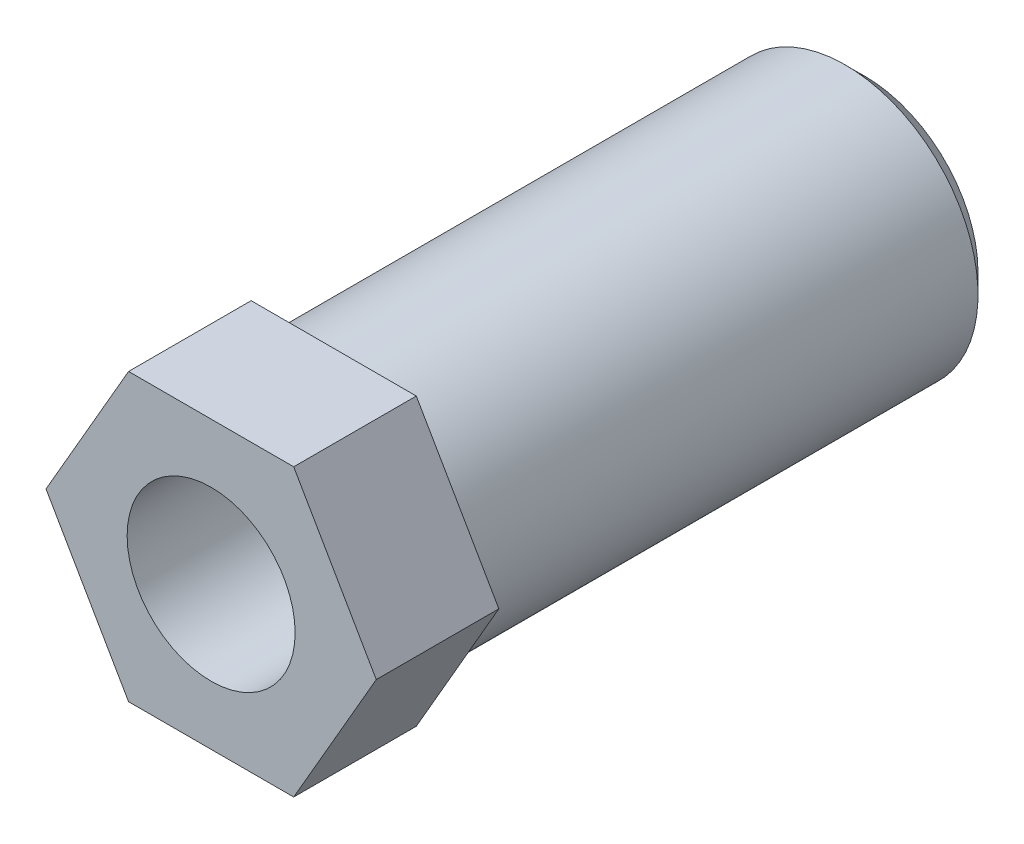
ISO-10303-21;
HEADER;
FILE_DESCRIPTION(('STEP AP214'),'2;1');
FILE_NAME('part.step','',(''),(''),'','','');
FILE_SCHEMA(('AUTOMOTIVE_DESIGN { 1 0 10303 214 1 1 1 1 }'));
ENDSEC;
DATA;
#1=APPLICATION_CONTEXT('core data for automotive mechanical design processes');
#2=APPLICATION_PROTOCOL_DEFINITION('international standard','automotive_design',2000,#1);
#3=PRODUCT_CONTEXT('',#1,'mechanical');
#4=PRODUCT('Part','Part','',(#3));
#5=PRODUCT_RELATED_PRODUCT_CATEGORY('part','',(#4));
#6=PRODUCT_DEFINITION_FORMATION('','',#4);
#7=PRODUCT_DEFINITION_CONTEXT('part definition',#1,'design');
#8=PRODUCT_DEFINITION('design','',#6,#7);
#9=PRODUCT_DEFINITION_SHAPE('','',#8);
#10=(LENGTH_UNIT() NAMED_UNIT(*) SI_UNIT(.MILLI.,.METRE.));
#11=(NAMED_UNIT(*) PLANE_ANGLE_UNIT() SI_UNIT($,.RADIAN.));
#12=(NAMED_UNIT(*) SI_UNIT($,.STERADIAN.) SOLID_ANGLE_UNIT());
#13=UNCERTAINTY_MEASURE_WITH_UNIT(LENGTH_MEASURE(1.E-05),#10,'distance_accuracy_value','');
#14=(GEOMETRIC_REPRESENTATION_CONTEXT(3) GLOBAL_UNCERTAINTY_ASSIGNED_CONTEXT((#13)) GLOBAL_UNIT_ASSIGNED_CONTEXT((#10,
#11,#12)) REPRESENTATION_CONTEXT('',''));
#15=CARTESIAN_POINT('',(0.,0.,0.));
#16=DIRECTION('',(0.,0.,1.));
#17=DIRECTION('',(1.,0.,0.));
#18=AXIS2_PLACEMENT_3D('',#15,#16,#17);
#19=CARTESIAN_POINT('',(3.20790243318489,-5.55625,25.4));
#20=DIRECTION('',(-0.866025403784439,0.5,0.));
#21=DIRECTION('',(-0.5,-0.866025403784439,0.));
#22=AXIS2_PLACEMENT_3D('',#19,#20,#21);
#23=PLANE('',#22);
#24=DIRECTION('',(-0.5,-0.866025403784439,0.));
#25=VECTOR('',#24,1.);
#26=CARTESIAN_POINT('',(3.20790243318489,-5.55625,20.6375));
#27=LINE('',#26,#25);
#28=CARTESIAN_POINT('',(6.41580486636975,0.,20.6375));
#29=VERTEX_POINT('',#28);
#30=CARTESIAN_POINT('',(3.20790243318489,-5.55625,20.6375));
#31=VERTEX_POINT('',#30);
#32=EDGE_CURVE('E48',#29,#31,#27,.T.);
#33=ORIENTED_EDGE('',*,*,#32,.F.);
#34=DIRECTION('',(0.,0.,-1.));
#35=VECTOR('',#34,1.);
#36=CARTESIAN_POINT('',(6.41580486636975,0.,25.4));
#37=LINE('',#36,#35);
#38=CARTESIAN_POINT('',(6.41580486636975,0.,25.4));
#39=VERTEX_POINT('',#38);
#40=EDGE_CURVE('E93',#39,#29,#37,.T.);
#41=ORIENTED_EDGE('',*,*,#40,.F.);
#42=DIRECTION('',(0.5,0.866025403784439,0.));
#43=VECTOR('',#42,1.);
#44=CARTESIAN_POINT('',(3.20790243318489,-5.55625,25.4));
#45=LINE('',#44,#43);
#46=CARTESIAN_POINT('',(3.20790243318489,-5.55625,25.4));
#47=VERTEX_POINT('',#46);
#48=EDGE_CURVE('E161',#47,#39,#45,.T.);
#49=ORIENTED_EDGE('',*,*,#48,.F.);
#50=DIRECTION('',(0.,0.,-1.));
#51=VECTOR('',#50,1.);
#52=CARTESIAN_POINT('',(3.20790243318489,-5.55625,25.4));
#53=LINE('',#52,#51);
#54=EDGE_CURVE('E107',#47,#31,#53,.T.);
#55=ORIENTED_EDGE('',*,*,#54,.T.);
#56=EDGE_LOOP('',(#33,#41,#49,#55));
#57=FACE_BOUND('',#56,.T.);
#58=ADVANCED_FACE('F34',(#57),#23,.F.);
#59=CARTESIAN_POINT('',(6.41580486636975,0.,25.4));
#60=DIRECTION('',(-0.866025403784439,-0.5,0.));
#61=DIRECTION('',(0.5,-0.866025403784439,0.));
#62=AXIS2_PLACEMENT_3D('',#59,#60,#61);
#63=PLANE('',#62);
#64=DIRECTION('',(0.5,-0.866025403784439,0.));
#65=VECTOR('',#64,1.);
#66=CARTESIAN_POINT('',(6.41580486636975,0.,20.6375));
#67=LINE('',#66,#65);
#68=CARTESIAN_POINT('',(3.20790243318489,5.55625,20.6375));
#69=VERTEX_POINT('',#68);
#70=EDGE_CURVE('E154',#69,#29,#67,.T.);
#71=ORIENTED_EDGE('',*,*,#70,.F.);
#72=DIRECTION('',(0.,0.,-1.));
#73=VECTOR('',#72,1.);
#74=CARTESIAN_POINT('',(3.20790243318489,5.55625,25.4));
#75=LINE('',#74,#73);
#76=CARTESIAN_POINT('',(3.20790243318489,5.55625,25.4));
#77=VERTEX_POINT('',#76);
#78=EDGE_CURVE('E116',#77,#69,#75,.T.);
#79=ORIENTED_EDGE('',*,*,#78,.F.);
#80=DIRECTION('',(-0.5,0.866025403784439,0.));
#81=VECTOR('',#80,1.);
#82=CARTESIAN_POINT('',(6.41580486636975,0.,25.4));
#83=LINE('',#82,#81);
#84=EDGE_CURVE('E158',#39,#77,#83,.T.);
#85=ORIENTED_EDGE('',*,*,#84,.F.);
#86=ORIENTED_EDGE('',*,*,#40,.T.);
#87=EDGE_LOOP('',(#71,#79,#85,#86));
#88=FACE_BOUND('',#87,.T.);
#89=ADVANCED_FACE('F144',(#88),#63,.F.);
#90=CARTESIAN_POINT('',(3.20790243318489,5.55625,25.4));
#91=DIRECTION('',(0.,-1.,0.));
#92=DIRECTION('',(0.,0.,-1.));
#93=AXIS2_PLACEMENT_3D('',#90,#91,#92);
#94=PLANE('',#93);
#95=DIRECTION('',(1.,0.,0.));
#96=VECTOR('',#95,1.);
#97=CARTESIAN_POINT('',(3.20790243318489,5.55625,20.6375));
#98=LINE('',#97,#96);
#99=CARTESIAN_POINT('',(-3.20790243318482,5.55625,20.6375));
#100=VERTEX_POINT('',#99);
#101=EDGE_CURVE('E177',#100,#69,#98,.T.);
#102=ORIENTED_EDGE('',*,*,#101,.F.);
#103=DIRECTION('',(0.,0.,-1.));
#104=VECTOR('',#103,1.);
#105=CARTESIAN_POINT('',(-3.20790243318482,5.55625,25.4));
#106=LINE('',#105,#104);
#107=CARTESIAN_POINT('',(-3.20790243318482,5.55625,25.4));
#108=VERTEX_POINT('',#107);
#109=EDGE_CURVE('E109',#108,#100,#106,.T.);
#110=ORIENTED_EDGE('',*,*,#109,.F.);
#111=DIRECTION('',(-1.,0.,0.));
#112=VECTOR('',#111,1.);
#113=CARTESIAN_POINT('',(3.20790243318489,5.55625,25.4));
#114=LINE('',#113,#112);
#115=EDGE_CURVE('E160',#77,#108,#114,.T.);
#116=ORIENTED_EDGE('',*,*,#115,.F.);
#117=ORIENTED_EDGE('',*,*,#78,.T.);
#118=EDGE_LOOP('',(#102,#110,#116,#117));
#119=FACE_BOUND('',#118,.T.);
#120=ADVANCED_FACE('F149',(#119),#94,.F.);
#121=CARTESIAN_POINT('',(-3.20790243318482,5.55625,25.4));
#122=DIRECTION('',(0.866025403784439,-0.5,0.));
#123=DIRECTION('',(0.5,0.866025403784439,0.));
#124=AXIS2_PLACEMENT_3D('',#121,#122,#123);
#125=PLANE('',#124);
#126=DIRECTION('',(0.5,0.866025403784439,0.));
#127=VECTOR('',#126,1.);
#128=CARTESIAN_POINT('',(-3.20790243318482,5.55625,20.6375));
#129=LINE('',#128,#127);
#130=CARTESIAN_POINT('',(-6.41580486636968,0.,20.6375));
#131=VERTEX_POINT('',#130);
#132=EDGE_CURVE('E103',#131,#100,#129,.T.);
#133=ORIENTED_EDGE('',*,*,#132,.F.);
#134=DIRECTION('',(0.,0.,-1.));
#135=VECTOR('',#134,1.);
#136=CARTESIAN_POINT('',(-6.41580486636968,0.,25.4));
#137=LINE('',#136,#135);
#138=CARTESIAN_POINT('',(-6.41580486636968,0.,25.4));
#139=VERTEX_POINT('',#138);
#140=EDGE_CURVE('E102',#139,#131,#137,.T.);
#141=ORIENTED_EDGE('',*,*,#140,.F.);
#142=DIRECTION('',(-0.5,-0.866025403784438,0.));
#143=VECTOR('',#142,1.);
#144=CARTESIAN_POINT('',(-3.20790243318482,5.55625,25.4));
#145=LINE('',#144,#143);
#146=EDGE_CURVE('E169',#108,#139,#145,.T.);
#147=ORIENTED_EDGE('',*,*,#146,.F.);
#148=ORIENTED_EDGE('',*,*,#109,.T.);
#149=EDGE_LOOP('',(#133,#141,#147,#148));
#150=FACE_BOUND('',#149,.T.);
#151=ADVANCED_FACE('F175',(#150),#125,.F.);
#152=CARTESIAN_POINT('',(-6.41580486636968,0.,25.4));
#153=DIRECTION('',(0.866025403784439,0.5,0.));
#154=DIRECTION('',(-0.5,0.866025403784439,0.));
#155=AXIS2_PLACEMENT_3D('',#152,#153,#154);
#156=PLANE('',#155);
#157=DIRECTION('',(-0.5,0.866025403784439,0.));
#158=VECTOR('',#157,1.);
#159=CARTESIAN_POINT('',(-6.41580486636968,0.,20.6375));
#160=LINE('',#159,#158);
#161=CARTESIAN_POINT('',(-3.20790243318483,-5.55625,20.6375));
#162=VERTEX_POINT('',#161);
#163=EDGE_CURVE('E87',#162,#131,#160,.T.);
#164=ORIENTED_EDGE('',*,*,#163,.F.);
#165=DIRECTION('',(0.,0.,-1.));
#166=VECTOR('',#165,1.);
#167=CARTESIAN_POINT('',(-3.20790243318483,-5.55625,25.4));
#168=LINE('',#167,#166);
#169=CARTESIAN_POINT('',(-3.20790243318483,-5.55625,25.4));
#170=VERTEX_POINT('',#169);
#171=EDGE_CURVE('E100',#170,#162,#168,.T.);
#172=ORIENTED_EDGE('',*,*,#171,.F.);
#173=DIRECTION('',(0.5,-0.866025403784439,0.));
#174=VECTOR('',#173,1.);
#175=CARTESIAN_POINT('',(-6.41580486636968,0.,25.4));
#176=LINE('',#175,#174);
#177=EDGE_CURVE('E171',#139,#170,#176,.T.);
#178=ORIENTED_EDGE('',*,*,#177,.F.);
#179=ORIENTED_EDGE('',*,*,#140,.T.);
#180=EDGE_LOOP('',(#164,#172,#178,#179));
#181=FACE_BOUND('',#180,.T.);
#182=ADVANCED_FACE('F98',(#181),#156,.F.);
#183=CARTESIAN_POINT('',(-3.20790243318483,-5.55625,25.4));
#184=DIRECTION('',(0.,1.,0.));
#185=DIRECTION('',(-1.,0.,0.));
#186=AXIS2_PLACEMENT_3D('',#183,#184,#185);
#187=PLANE('',#186);
#188=DIRECTION('',(-1.,0.,0.));
#189=VECTOR('',#188,1.);
#190=CARTESIAN_POINT('',(-3.20790243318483,-5.55625,20.6375));
#191=LINE('',#190,#189);
#192=EDGE_CURVE('E84',#31,#162,#191,.T.);
#193=ORIENTED_EDGE('',*,*,#192,.F.);
#194=ORIENTED_EDGE('',*,*,#54,.F.);
#195=DIRECTION('',(1.,0.,0.));
#196=VECTOR('',#195,1.);
#197=CARTESIAN_POINT('',(-3.20790243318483,-5.55625,25.4));
#198=LINE('',#197,#196);
#199=EDGE_CURVE('E56',#170,#47,#198,.T.);
#200=ORIENTED_EDGE('',*,*,#199,.F.);
#201=ORIENTED_EDGE('',*,*,#171,.T.);
#202=EDGE_LOOP('',(#193,#194,#200,#201));
#203=FACE_BOUND('',#202,.T.);
#204=ADVANCED_FACE('F106',(#203),#187,.F.);
#205=CARTESIAN_POINT('',(3.20790243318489,-5.55625,0.));
#206=DIRECTION('',(0.,0.,-1.));
#207=DIRECTION('',(-1.,0.,0.));
#208=AXIS2_PLACEMENT_3D('',#205,#206,#207);
#209=PLANE('',#208);
#210=CARTESIAN_POINT('',(0.,0.,0.));
#211=DIRECTION('',(0.,0.,-1.));
#212=DIRECTION('',(-1.,0.,0.));
#213=AXIS2_PLACEMENT_3D('',#210,#211,#212);
#214=CIRCLE('',#213,4.02589999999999);
#215=CARTESIAN_POINT('',(-4.02589999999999,0.,0.));
#216=VERTEX_POINT('',#215);
#217=EDGE_CURVE('E11',#216,#216,#214,.F.);
#218=ORIENTED_EDGE('',*,*,#217,.T.);
#219=EDGE_LOOP('',(#218));
#220=FACE_BOUND('',#219,.T.);
#221=CARTESIAN_POINT('',(0.,0.,0.));
#222=DIRECTION('',(0.,0.,-1.));
#223=DIRECTION('',(-1.,0.,0.));
#224=AXIS2_PLACEMENT_3D('',#221,#222,#223);
#225=CIRCLE('',#224,4.39419999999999);
#226=CARTESIAN_POINT('',(-4.39419999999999,0.,0.));
#227=VERTEX_POINT('',#226);
#228=EDGE_CURVE('E92',#227,#227,#225,.T.);
#229=ORIENTED_EDGE('',*,*,#228,.T.);
#230=EDGE_LOOP('',(#229));
#231=FACE_BOUND('',#230,.T.);
#232=ADVANCED_FACE('F194',(#220,#231),#209,.T.);
#233=CARTESIAN_POINT('',(3.20790243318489,-5.55625,25.4));
#234=DIRECTION('',(0.,0.,-1.));
#235=DIRECTION('',(-1.,0.,0.));
#236=AXIS2_PLACEMENT_3D('',#233,#234,#235);
#237=PLANE('',#236);
#238=CARTESIAN_POINT('',(0.,0.,25.4));
#239=DIRECTION('',(0.,0.,-1.));
#240=DIRECTION('',(-1.,0.,0.));
#241=AXIS2_PLACEMENT_3D('',#238,#239,#240);
#242=CIRCLE('',#241,3.26389999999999);
#243=CARTESIAN_POINT('',(-3.26389999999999,0.,25.4));
#244=VERTEX_POINT('',#243);
#245=EDGE_CURVE('E153',#244,#244,#242,.T.);
#246=ORIENTED_EDGE('',*,*,#245,.T.);
#247=EDGE_LOOP('',(#246));
#248=FACE_BOUND('',#247,.T.);
#249=ORIENTED_EDGE('',*,*,#48,.T.);
#250=ORIENTED_EDGE('',*,*,#84,.T.);
#251=ORIENTED_EDGE('',*,*,#115,.T.);
#252=ORIENTED_EDGE('',*,*,#146,.T.);
#253=ORIENTED_EDGE('',*,*,#177,.T.);
#254=ORIENTED_EDGE('',*,*,#199,.T.);
#255=EDGE_LOOP('',(#249,#250,#251,#252,#253,#254));
#256=FACE_BOUND('',#255,.T.);
#257=ADVANCED_FACE('F163',(#248,#256),#237,.F.);
#258=CARTESIAN_POINT('',(0.,0.,0.));
#259=DIRECTION('',(0.,0.,-1.));
#260=DIRECTION('',(-1.,0.,0.));
#261=AXIS2_PLACEMENT_3D('',#258,#259,#260);
#262=CYLINDRICAL_SURFACE('',#261,3.26389999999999);
#263=CARTESIAN_POINT('',(0.,0.,0.761999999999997));
#264=DIRECTION('',(0.,0.,-1.));
#265=DIRECTION('',(-1.,0.,0.));
#266=AXIS2_PLACEMENT_3D('',#263,#264,#265);
#267=CIRCLE('',#266,3.26389999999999);
#268=CARTESIAN_POINT('',(-3.26389999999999,0.,0.761999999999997));
#269=VERTEX_POINT('',#268);
#270=EDGE_CURVE('E41',#269,#269,#267,.T.);
#271=ORIENTED_EDGE('',*,*,#270,.T.);
#272=EDGE_LOOP('',(#271));
#273=FACE_BOUND('',#272,.T.);
#274=ORIENTED_EDGE('',*,*,#245,.F.);
#275=EDGE_LOOP('',(#274));
#276=FACE_BOUND('',#275,.T.);
#277=ADVANCED_FACE('F128',(#273,#276),#262,.F.);
#278=CARTESIAN_POINT('',(0.,0.,20.6375));
#279=DIRECTION('',(0.,0.,-1.));
#280=DIRECTION('',(-1.,0.,0.));
#281=AXIS2_PLACEMENT_3D('',#278,#279,#280);
#282=PLANE('',#281);
#283=CARTESIAN_POINT('',(0.,0.,20.6375));
#284=DIRECTION('',(0.,0.,-1.));
#285=DIRECTION('',(-1.,0.,0.));
#286=AXIS2_PLACEMENT_3D('',#283,#284,#285);
#287=CIRCLE('',#286,5.1562);
#288=CARTESIAN_POINT('',(-5.1562,0.,20.6375));
#289=VERTEX_POINT('',#288);
#290=EDGE_CURVE('E104',#289,#289,#287,.T.);
#291=ORIENTED_EDGE('',*,*,#290,.F.);
#292=EDGE_LOOP('',(#291));
#293=FACE_BOUND('',#292,.T.);
#294=ORIENTED_EDGE('',*,*,#32,.T.);
#295=ORIENTED_EDGE('',*,*,#192,.T.);
#296=ORIENTED_EDGE('',*,*,#163,.T.);
#297=ORIENTED_EDGE('',*,*,#132,.T.);
#298=ORIENTED_EDGE('',*,*,#101,.T.);
#299=ORIENTED_EDGE('',*,*,#70,.T.);
#300=EDGE_LOOP('',(#294,#295,#296,#297,#298,#299));
#301=FACE_BOUND('',#300,.T.);
#302=ADVANCED_FACE('F86',(#293,#301),#282,.T.);
#303=CARTESIAN_POINT('',(0.,0.,20.6375));
#304=DIRECTION('',(0.,0.,-1.));
#305=DIRECTION('',(-1.,0.,0.));
#306=AXIS2_PLACEMENT_3D('',#303,#304,#305);
#307=CYLINDRICAL_SURFACE('',#306,5.1562);
#308=CARTESIAN_POINT('',(0.,0.,0.762000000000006));
#309=DIRECTION('',(0.,0.,-1.));
#310=DIRECTION('',(-1.,0.,0.));
#311=AXIS2_PLACEMENT_3D('',#308,#309,#310);
#312=CIRCLE('',#311,5.1562);
#313=CARTESIAN_POINT('',(-5.1562,0.,0.762000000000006));
#314=VERTEX_POINT('',#313);
#315=EDGE_CURVE('E123',#314,#314,#312,.F.);
#316=ORIENTED_EDGE('',*,*,#315,.T.);
#317=EDGE_LOOP('',(#316));
#318=FACE_BOUND('',#317,.T.);
#319=ORIENTED_EDGE('',*,*,#290,.T.);
#320=EDGE_LOOP('',(#319));
#321=FACE_BOUND('',#320,.T.);
#322=ADVANCED_FACE('F139',(#318,#321),#307,.T.);
#323=CARTESIAN_POINT('',(0.,0.,0.));
#324=DIRECTION('',(0.,0.,1.));
#325=DIRECTION('',(1.,0.,0.));
#326=AXIS2_PLACEMENT_3D('',#323,#324,#325);
#327=CONICAL_SURFACE('',#326,4.39419999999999,0.785398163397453);
#328=ORIENTED_EDGE('',*,*,#315,.F.);
#329=EDGE_LOOP('',(#328));
#330=FACE_BOUND('',#329,.T.);
#331=ORIENTED_EDGE('',*,*,#228,.F.);
#332=EDGE_LOOP('',(#331));
#333=FACE_BOUND('',#332,.T.);
#334=ADVANCED_FACE('F133',(#330,#333),#327,.T.);
#335=CARTESIAN_POINT('',(0.,0.,0.761999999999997));
#336=DIRECTION('',(0.,0.,-1.));
#337=DIRECTION('',(-1.,0.,0.));
#338=AXIS2_PLACEMENT_3D('',#335,#336,#337);
#339=CONICAL_SURFACE('',#338,3.26389999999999,0.78539816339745);
#340=CARTESIAN_POINT('',(-4.02589999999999,0.,0.));
#341=CARTESIAN_POINT('',(-4.01796249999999,0.,0.00793749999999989));
#342=CARTESIAN_POINT('',(-4.01002499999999,0.,0.0158749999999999));
#343=CARTESIAN_POINT('',(-3.99414999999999,0.,0.03175));
#344=CARTESIAN_POINT('',(-3.98621249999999,0.,0.0396875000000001));
#345=CARTESIAN_POINT('',(-3.97033749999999,0.,0.0555625));
#346=CARTESIAN_POINT('',(-3.96239999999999,0.,0.0634999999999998));
#347=CARTESIAN_POINT('',(-3.94652499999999,0.,0.0793749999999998));
#348=CARTESIAN_POINT('',(-3.93858749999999,0.,0.0873124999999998));
#349=CARTESIAN_POINT('',(-3.92271249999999,0.,0.1031875));
#350=CARTESIAN_POINT('',(-3.91477499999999,0.,0.111125));
#351=CARTESIAN_POINT('',(-3.89889999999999,0.,0.127));
#352=CARTESIAN_POINT('',(-3.89096249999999,0.,0.1349375));
#353=CARTESIAN_POINT('',(-3.87508749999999,0.,0.1508125));
#354=CARTESIAN_POINT('',(-3.86714999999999,0.,0.15875));
#355=CARTESIAN_POINT('',(-3.85127499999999,0.,0.174624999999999));
#356=CARTESIAN_POINT('',(-3.84333749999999,0.,0.1825625));
#357=CARTESIAN_POINT('',(-3.82746249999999,0.,0.198437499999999));
#358=CARTESIAN_POINT('',(-3.81952499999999,0.,0.206374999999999));
#359=CARTESIAN_POINT('',(-3.80364999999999,0.,0.222249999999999));
#360=CARTESIAN_POINT('',(-3.79571249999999,0.,0.230187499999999));
#361=CARTESIAN_POINT('',(-3.77983749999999,0.,0.246062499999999));
#362=CARTESIAN_POINT('',(-3.77189999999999,0.,0.253999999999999));
#363=CARTESIAN_POINT('',(-3.75602499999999,0.,0.269874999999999));
#364=CARTESIAN_POINT('',(-3.74808749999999,0.,0.277812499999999));
#365=CARTESIAN_POINT('',(-3.73221249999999,0.,0.293687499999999));
#366=CARTESIAN_POINT('',(-3.72427499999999,0.,0.301624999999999));
#367=CARTESIAN_POINT('',(-3.70839999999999,0.,0.317499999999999));
#368=CARTESIAN_POINT('',(-3.70046249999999,0.,0.325437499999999));
#369=CARTESIAN_POINT('',(-3.68458749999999,0.,0.341312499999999));
#370=CARTESIAN_POINT('',(-3.67664999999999,0.,0.349249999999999));
#371=CARTESIAN_POINT('',(-3.66077499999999,0.,0.365124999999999));
#372=CARTESIAN_POINT('',(-3.65283749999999,0.,0.373062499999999));
#373=CARTESIAN_POINT('',(-3.63696249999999,0.,0.388937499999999));
#374=CARTESIAN_POINT('',(-3.62902499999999,0.,0.396874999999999));
#375=CARTESIAN_POINT('',(-3.61314999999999,0.,0.412749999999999));
#376=CARTESIAN_POINT('',(-3.60521249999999,0.,0.420687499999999));
#377=CARTESIAN_POINT('',(-3.58933749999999,0.,0.436562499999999));
#378=CARTESIAN_POINT('',(-3.58139999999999,0.,0.444499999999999));
#379=CARTESIAN_POINT('',(-3.56552499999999,0.,0.460374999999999));
#380=CARTESIAN_POINT('',(-3.55758749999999,0.,0.468312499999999));
#381=CARTESIAN_POINT('',(-3.54171249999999,0.,0.484187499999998));
#382=CARTESIAN_POINT('',(-3.53377499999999,0.,0.492124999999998));
#383=CARTESIAN_POINT('',(-3.51789999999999,0.,0.507999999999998));
#384=CARTESIAN_POINT('',(-3.50996249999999,0.,0.515937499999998));
#385=CARTESIAN_POINT('',(-3.49408749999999,0.,0.531812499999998));
#386=CARTESIAN_POINT('',(-3.48614999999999,0.,0.539749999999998));
#387=CARTESIAN_POINT('',(-3.47027499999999,0.,0.555624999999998));
#388=CARTESIAN_POINT('',(-3.46233749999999,0.,0.563562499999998));
#389=CARTESIAN_POINT('',(-3.44646249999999,0.,0.579437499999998));
#390=CARTESIAN_POINT('',(-3.43852499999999,0.,0.587374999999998));
#391=CARTESIAN_POINT('',(-3.42264999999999,0.,0.603249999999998));
#392=CARTESIAN_POINT('',(-3.41471249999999,0.,0.611187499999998));
#393=CARTESIAN_POINT('',(-3.39883749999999,0.,0.627062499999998));
#394=CARTESIAN_POINT('',(-3.39089999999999,0.,0.634999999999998));
#395=CARTESIAN_POINT('',(-3.37502499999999,0.,0.650874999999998));
#396=CARTESIAN_POINT('',(-3.36708749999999,0.,0.658812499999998));
#397=CARTESIAN_POINT('',(-3.35121249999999,0.,0.674687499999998));
#398=CARTESIAN_POINT('',(-3.34327499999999,0.,0.682624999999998));
#399=CARTESIAN_POINT('',(-3.32739999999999,0.,0.698499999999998));
#400=CARTESIAN_POINT('',(-3.31946249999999,0.,0.706437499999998));
#401=CARTESIAN_POINT('',(-3.30358749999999,0.,0.722312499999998));
#402=CARTESIAN_POINT('',(-3.29564999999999,0.,0.730249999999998));
#403=CARTESIAN_POINT('',(-3.27977499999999,0.,0.746124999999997));
#404=CARTESIAN_POINT('',(-3.27183749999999,0.,0.754062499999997));
#405=CARTESIAN_POINT('',(-3.26389999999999,0.,0.761999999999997));
#406=B_SPLINE_CURVE_WITH_KNOTS('',3,(#340,#341,#342,#343,#344,#345,#346,#347,#348,#349,#350,
#351,#352,#353,#354,#355,#356,#357,#358,#359,#360,#361,#362,#363,#364,#365,#366,#367,#368,#369,
#370,#371,#372,#373,#374,#375,#376,#377,#378,#379,#380,#381,#382,#383,#384,#385,#386,#387,#388,
#389,#390,#391,#392,#393,#394,#395,#396,#397,#398,#399,#400,#401,#402,#403,#404,#405),
.UNSPECIFIED.,.F.,.F.,(4,2,2,2,2,2,2,2,2,2,2,2,2,2,2,2,2,2,2,2,2,2,2,2,2,2,2,2,2,2,2,2,4),(0.,
0.0336759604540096,0.0673519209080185,0.101027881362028,0.134703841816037,0.168379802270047,
0.202055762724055,0.235731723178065,0.269407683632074,0.303083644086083,0.336759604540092,
0.370435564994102,0.404111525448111,0.43778748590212,0.47146344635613,0.505139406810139,
0.538815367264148,0.572491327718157,0.606167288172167,0.639843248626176,0.673519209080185,
0.707195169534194,0.740871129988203,0.774547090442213,0.808223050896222,0.841899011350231,
0.875574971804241,0.90925093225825,0.942926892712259,0.976602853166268,1.01027881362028,
1.04395477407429,1.0776307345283),.UNSPECIFIED.);
#407=EDGE_CURVE('BSEAM131',#216,#269,#406,.T.);
#408=ORIENTED_EDGE('',*,*,#217,.F.);
#409=ORIENTED_EDGE('',*,*,#270,.F.);
#410=ORIENTED_EDGE('',*,*,#407,.T.);
#411=ORIENTED_EDGE('',*,*,#407,.F.);
#412=EDGE_LOOP('',(#408,#410,#409,#411));
#413=FACE_BOUND('',#412,.T.);
#414=ADVANCED_FACE('F131',(#413),#339,.F.);
#415=CLOSED_SHELL('',(#58,#89,#120,#151,#182,#204,#232,#257,#277,#302,#322,#334,#414));
#416=MANIFOLD_SOLID_BREP('B2',#415);
#417=ADVANCED_BREP_SHAPE_REPRESENTATION('',(#18,#416),#14);
#418=SHAPE_DEFINITION_REPRESENTATION(#9,#417);
ENDSEC;
END-ISO-10303-21;
